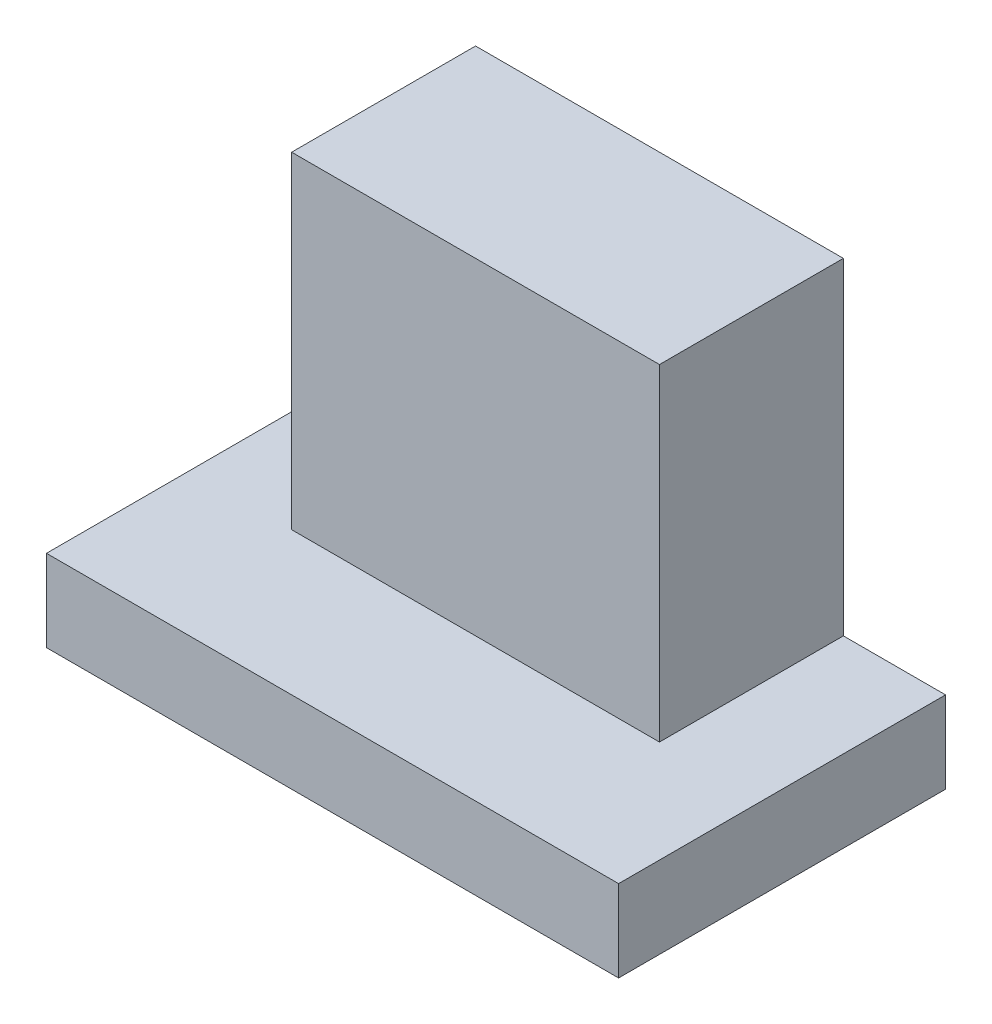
ISO-10303-21;
HEADER;
FILE_DESCRIPTION(('STEP AP214'),'2;1');
FILE_NAME('part.step','',(''),(''),'','','');
FILE_SCHEMA(('AUTOMOTIVE_DESIGN { 1 0 10303 214 1 1 1 1 }'));
ENDSEC;
DATA;
#1=APPLICATION_CONTEXT('core data for automotive mechanical design processes');
#2=APPLICATION_PROTOCOL_DEFINITION('international standard','automotive_design',2000,#1);
#3=PRODUCT_CONTEXT('',#1,'mechanical');
#4=PRODUCT('Part','Part','',(#3));
#5=PRODUCT_RELATED_PRODUCT_CATEGORY('part','',(#4));
#6=PRODUCT_DEFINITION_FORMATION('','',#4);
#7=PRODUCT_DEFINITION_CONTEXT('part definition',#1,'design');
#8=PRODUCT_DEFINITION('design','',#6,#7);
#9=PRODUCT_DEFINITION_SHAPE('','',#8);
#10=(LENGTH_UNIT() NAMED_UNIT(*) SI_UNIT(.MILLI.,.METRE.));
#11=(NAMED_UNIT(*) PLANE_ANGLE_UNIT() SI_UNIT($,.RADIAN.));
#12=(NAMED_UNIT(*) SI_UNIT($,.STERADIAN.) SOLID_ANGLE_UNIT());
#13=UNCERTAINTY_MEASURE_WITH_UNIT(LENGTH_MEASURE(1.E-05),#10,'distance_accuracy_value','');
#14=(GEOMETRIC_REPRESENTATION_CONTEXT(3) GLOBAL_UNCERTAINTY_ASSIGNED_CONTEXT((#13)) GLOBAL_UNIT_ASSIGNED_CONTEXT((#10,
#11,#12)) REPRESENTATION_CONTEXT('',''));
#15=CARTESIAN_POINT('',(0.,0.,0.));
#16=DIRECTION('',(0.,0.,1.));
#17=DIRECTION('',(1.,0.,0.));
#18=AXIS2_PLACEMENT_3D('',#15,#16,#17);
#19=CARTESIAN_POINT('',(-70.,20.,0.));
#20=DIRECTION('',(1.,0.,0.));
#21=DIRECTION('',(0.,0.,-1.));
#22=AXIS2_PLACEMENT_3D('',#19,#20,#21);
#23=PLANE('',#22);
#24=DIRECTION('',(0.,0.,1.));
#25=VECTOR('',#24,1.);
#26=CARTESIAN_POINT('',(-70.,0.,0.));
#27=LINE('',#26,#25);
#28=CARTESIAN_POINT('',(-70.,0.,0.));
#29=VERTEX_POINT('',#28);
#30=CARTESIAN_POINT('',(-70.,0.,80.));
#31=VERTEX_POINT('',#30);
#32=EDGE_CURVE('E117',#29,#31,#27,.T.);
#33=ORIENTED_EDGE('',*,*,#32,.T.);
#34=DIRECTION('',(0.,-1.,0.));
#35=VECTOR('',#34,1.);
#36=CARTESIAN_POINT('',(-70.,20.,80.));
#37=LINE('',#36,#35);
#38=CARTESIAN_POINT('',(-70.,20.,80.));
#39=VERTEX_POINT('',#38);
#40=EDGE_CURVE('E11',#39,#31,#37,.T.);
#41=ORIENTED_EDGE('',*,*,#40,.F.);
#42=DIRECTION('',(0.,0.,1.));
#43=VECTOR('',#42,1.);
#44=CARTESIAN_POINT('',(-70.,20.,0.));
#45=LINE('',#44,#43);
#46=CARTESIAN_POINT('',(-70.,20.,0.));
#47=VERTEX_POINT('',#46);
#48=EDGE_CURVE('E126',#47,#39,#45,.T.);
#49=ORIENTED_EDGE('',*,*,#48,.F.);
#50=DIRECTION('',(0.,-1.,0.));
#51=VECTOR('',#50,1.);
#52=CARTESIAN_POINT('',(-70.,20.,0.));
#53=LINE('',#52,#51);
#54=EDGE_CURVE('E142',#47,#29,#53,.T.);
#55=ORIENTED_EDGE('',*,*,#54,.T.);
#56=EDGE_LOOP('',(#33,#41,#49,#55));
#57=FACE_BOUND('',#56,.T.);
#58=ADVANCED_FACE('F31',(#57),#23,.F.);
#59=CARTESIAN_POINT('',(-70.,20.,80.));
#60=DIRECTION('',(0.,0.,-1.));
#61=DIRECTION('',(-1.,0.,0.));
#62=AXIS2_PLACEMENT_3D('',#59,#60,#61);
#63=PLANE('',#62);
#64=DIRECTION('',(1.,0.,0.));
#65=VECTOR('',#64,1.);
#66=CARTESIAN_POINT('',(-70.,0.,80.));
#67=LINE('',#66,#65);
#68=CARTESIAN_POINT('',(70.,0.,80.));
#69=VERTEX_POINT('',#68);
#70=EDGE_CURVE('E120',#31,#69,#67,.T.);
#71=ORIENTED_EDGE('',*,*,#70,.T.);
#72=DIRECTION('',(0.,-1.,0.));
#73=VECTOR('',#72,1.);
#74=CARTESIAN_POINT('',(70.,20.,80.));
#75=LINE('',#74,#73);
#76=CARTESIAN_POINT('',(70.,20.,80.));
#77=VERTEX_POINT('',#76);
#78=EDGE_CURVE('E39',#77,#69,#75,.T.);
#79=ORIENTED_EDGE('',*,*,#78,.F.);
#80=DIRECTION('',(1.,0.,0.));
#81=VECTOR('',#80,1.);
#82=CARTESIAN_POINT('',(-70.,20.,80.));
#83=LINE('',#82,#81);
#84=EDGE_CURVE('E129',#39,#77,#83,.T.);
#85=ORIENTED_EDGE('',*,*,#84,.F.);
#86=ORIENTED_EDGE('',*,*,#40,.T.);
#87=EDGE_LOOP('',(#71,#79,#85,#86));
#88=FACE_BOUND('',#87,.T.);
#89=ADVANCED_FACE('F155',(#88),#63,.F.);
#90=CARTESIAN_POINT('',(70.,20.,0.));
#91=DIRECTION('',(-1.,0.,0.));
#92=DIRECTION('',(0.,0.,1.));
#93=AXIS2_PLACEMENT_3D('',#90,#91,#92);
#94=PLANE('',#93);
#95=DIRECTION('',(0.,0.,-1.));
#96=VECTOR('',#95,1.);
#97=CARTESIAN_POINT('',(70.,0.,0.));
#98=LINE('',#97,#96);
#99=CARTESIAN_POINT('',(70.,0.,0.));
#100=VERTEX_POINT('',#99);
#101=EDGE_CURVE('E152',#69,#100,#98,.T.);
#102=ORIENTED_EDGE('',*,*,#101,.T.);
#103=DIRECTION('',(0.,-1.,0.));
#104=VECTOR('',#103,1.);
#105=CARTESIAN_POINT('',(70.,20.,0.));
#106=LINE('',#105,#104);
#107=CARTESIAN_POINT('',(70.,20.,0.));
#108=VERTEX_POINT('',#107);
#109=EDGE_CURVE('E146',#108,#100,#106,.T.);
#110=ORIENTED_EDGE('',*,*,#109,.F.);
#111=DIRECTION('',(0.,0.,-1.));
#112=VECTOR('',#111,1.);
#113=CARTESIAN_POINT('',(70.,20.,0.));
#114=LINE('',#113,#112);
#115=EDGE_CURVE('E132',#77,#108,#114,.T.);
#116=ORIENTED_EDGE('',*,*,#115,.F.);
#117=ORIENTED_EDGE('',*,*,#78,.T.);
#118=EDGE_LOOP('',(#102,#110,#116,#117));
#119=FACE_BOUND('',#118,.T.);
#120=ADVANCED_FACE('F162',(#119),#94,.F.);
#121=CARTESIAN_POINT('',(-70.,20.,0.));
#122=DIRECTION('',(0.,0.,1.));
#123=DIRECTION('',(1.,0.,0.));
#124=AXIS2_PLACEMENT_3D('',#121,#122,#123);
#125=PLANE('',#124);
#126=DIRECTION('',(-1.,0.,0.));
#127=VECTOR('',#126,1.);
#128=CARTESIAN_POINT('',(-70.,0.,0.));
#129=LINE('',#128,#127);
#130=EDGE_CURVE('E130',#100,#29,#129,.T.);
#131=ORIENTED_EDGE('',*,*,#130,.T.);
#132=ORIENTED_EDGE('',*,*,#54,.F.);
#133=DIRECTION('',(-1.,0.,0.));
#134=VECTOR('',#133,1.);
#135=CARTESIAN_POINT('',(-70.,20.,0.));
#136=LINE('',#135,#134);
#137=CARTESIAN_POINT('',(-45.,20.,0.));
#138=VERTEX_POINT('',#137);
#139=EDGE_CURVE('E134',#138,#47,#136,.T.);
#140=ORIENTED_EDGE('',*,*,#139,.F.);
#141=DIRECTION('',(0.,-1.,0.));
#142=VECTOR('',#141,1.);
#143=CARTESIAN_POINT('',(-45.,100.,0.));
#144=LINE('',#143,#142);
#145=CARTESIAN_POINT('',(-45.,100.,0.));
#146=VERTEX_POINT('',#145);
#147=EDGE_CURVE('E173',#146,#138,#144,.T.);
#148=ORIENTED_EDGE('',*,*,#147,.F.);
#149=DIRECTION('',(-1.,0.,0.));
#150=VECTOR('',#149,1.);
#151=CARTESIAN_POINT('',(-45.,100.,0.));
#152=LINE('',#151,#150);
#153=CARTESIAN_POINT('',(45.,100.,0.));
#154=VERTEX_POINT('',#153);
#155=EDGE_CURVE('E110',#154,#146,#152,.T.);
#156=ORIENTED_EDGE('',*,*,#155,.F.);
#157=DIRECTION('',(0.,-1.,0.));
#158=VECTOR('',#157,1.);
#159=CARTESIAN_POINT('',(45.,100.,0.));
#160=LINE('',#159,#158);
#161=CARTESIAN_POINT('',(45.,20.,0.));
#162=VERTEX_POINT('',#161);
#163=EDGE_CURVE('E122',#154,#162,#160,.T.);
#164=ORIENTED_EDGE('',*,*,#163,.T.);
#165=EDGE_CURVE('E141',#108,#162,#136,.T.);
#166=ORIENTED_EDGE('',*,*,#165,.F.);
#167=ORIENTED_EDGE('',*,*,#109,.T.);
#168=EDGE_LOOP('',(#131,#132,#140,#148,#156,#164,#166,#167));
#169=FACE_BOUND('',#168,.T.);
#170=ADVANCED_FACE('F168',(#169),#125,.F.);
#171=CARTESIAN_POINT('',(-70.,20.,0.));
#172=DIRECTION('',(0.,1.,0.));
#173=DIRECTION('',(0.,0.,1.));
#174=AXIS2_PLACEMENT_3D('',#171,#172,#173);
#175=PLANE('',#174);
#176=DIRECTION('',(0.,0.,1.));
#177=VECTOR('',#176,1.);
#178=CARTESIAN_POINT('',(-45.,20.,0.));
#179=LINE('',#178,#177);
#180=CARTESIAN_POINT('',(-45.,20.,45.));
#181=VERTEX_POINT('',#180);
#182=EDGE_CURVE('E52',#138,#181,#179,.T.);
#183=ORIENTED_EDGE('',*,*,#182,.F.);
#184=ORIENTED_EDGE('',*,*,#139,.T.);
#185=ORIENTED_EDGE('',*,*,#48,.T.);
#186=ORIENTED_EDGE('',*,*,#84,.T.);
#187=ORIENTED_EDGE('',*,*,#115,.T.);
#188=ORIENTED_EDGE('',*,*,#165,.T.);
#189=DIRECTION('',(0.,0.,-1.));
#190=VECTOR('',#189,1.);
#191=CARTESIAN_POINT('',(45.,20.,0.));
#192=LINE('',#191,#190);
#193=CARTESIAN_POINT('',(45.,20.,45.));
#194=VERTEX_POINT('',#193);
#195=EDGE_CURVE('E114',#194,#162,#192,.T.);
#196=ORIENTED_EDGE('',*,*,#195,.F.);
#197=DIRECTION('',(1.,0.,0.));
#198=VECTOR('',#197,1.);
#199=CARTESIAN_POINT('',(-45.,20.,45.));
#200=LINE('',#199,#198);
#201=EDGE_CURVE('E47',#181,#194,#200,.T.);
#202=ORIENTED_EDGE('',*,*,#201,.F.);
#203=EDGE_LOOP('',(#183,#184,#185,#186,#187,#188,#196,#202));
#204=FACE_BOUND('',#203,.T.);
#205=ADVANCED_FACE('F172',(#204),#175,.T.);
#206=CARTESIAN_POINT('',(-70.,0.,0.));
#207=DIRECTION('',(0.,1.,0.));
#208=DIRECTION('',(0.,0.,1.));
#209=AXIS2_PLACEMENT_3D('',#206,#207,#208);
#210=PLANE('',#209);
#211=ORIENTED_EDGE('',*,*,#32,.F.);
#212=ORIENTED_EDGE('',*,*,#130,.F.);
#213=ORIENTED_EDGE('',*,*,#101,.F.);
#214=ORIENTED_EDGE('',*,*,#70,.F.);
#215=EDGE_LOOP('',(#211,#212,#213,#214));
#216=FACE_BOUND('',#215,.T.);
#217=ADVANCED_FACE('F165',(#216),#210,.F.);
#218=CARTESIAN_POINT('',(-45.,100.,0.));
#219=DIRECTION('',(1.,0.,0.));
#220=DIRECTION('',(0.,0.,-1.));
#221=AXIS2_PLACEMENT_3D('',#218,#219,#220);
#222=PLANE('',#221);
#223=ORIENTED_EDGE('',*,*,#182,.T.);
#224=DIRECTION('',(0.,-1.,0.));
#225=VECTOR('',#224,1.);
#226=CARTESIAN_POINT('',(-45.,100.,45.));
#227=LINE('',#226,#225);
#228=CARTESIAN_POINT('',(-45.,100.,45.));
#229=VERTEX_POINT('',#228);
#230=EDGE_CURVE('E99',#229,#181,#227,.T.);
#231=ORIENTED_EDGE('',*,*,#230,.F.);
#232=DIRECTION('',(0.,0.,1.));
#233=VECTOR('',#232,1.);
#234=CARTESIAN_POINT('',(-45.,100.,0.));
#235=LINE('',#234,#233);
#236=EDGE_CURVE('E105',#146,#229,#235,.T.);
#237=ORIENTED_EDGE('',*,*,#236,.F.);
#238=ORIENTED_EDGE('',*,*,#147,.T.);
#239=EDGE_LOOP('',(#223,#231,#237,#238));
#240=FACE_BOUND('',#239,.T.);
#241=ADVANCED_FACE('F116',(#240),#222,.F.);
#242=CARTESIAN_POINT('',(-45.,100.,45.));
#243=DIRECTION('',(0.,0.,-1.));
#244=DIRECTION('',(-1.,0.,0.));
#245=AXIS2_PLACEMENT_3D('',#242,#243,#244);
#246=PLANE('',#245);
#247=ORIENTED_EDGE('',*,*,#201,.T.);
#248=DIRECTION('',(0.,-1.,0.));
#249=VECTOR('',#248,1.);
#250=CARTESIAN_POINT('',(45.,100.,45.));
#251=LINE('',#250,#249);
#252=CARTESIAN_POINT('',(45.,100.,45.));
#253=VERTEX_POINT('',#252);
#254=EDGE_CURVE('E101',#253,#194,#251,.T.);
#255=ORIENTED_EDGE('',*,*,#254,.F.);
#256=DIRECTION('',(1.,0.,0.));
#257=VECTOR('',#256,1.);
#258=CARTESIAN_POINT('',(-45.,100.,45.));
#259=LINE('',#258,#257);
#260=EDGE_CURVE('E95',#229,#253,#259,.T.);
#261=ORIENTED_EDGE('',*,*,#260,.F.);
#262=ORIENTED_EDGE('',*,*,#230,.T.);
#263=EDGE_LOOP('',(#247,#255,#261,#262));
#264=FACE_BOUND('',#263,.T.);
#265=ADVANCED_FACE('F97',(#264),#246,.F.);
#266=CARTESIAN_POINT('',(45.,100.,0.));
#267=DIRECTION('',(-1.,0.,0.));
#268=DIRECTION('',(0.,0.,1.));
#269=AXIS2_PLACEMENT_3D('',#266,#267,#268);
#270=PLANE('',#269);
#271=ORIENTED_EDGE('',*,*,#195,.T.);
#272=ORIENTED_EDGE('',*,*,#163,.F.);
#273=DIRECTION('',(0.,0.,-1.));
#274=VECTOR('',#273,1.);
#275=CARTESIAN_POINT('',(45.,100.,0.));
#276=LINE('',#275,#274);
#277=EDGE_CURVE('E104',#253,#154,#276,.T.);
#278=ORIENTED_EDGE('',*,*,#277,.F.);
#279=ORIENTED_EDGE('',*,*,#254,.T.);
#280=EDGE_LOOP('',(#271,#272,#278,#279));
#281=FACE_BOUND('',#280,.T.);
#282=ADVANCED_FACE('F188',(#281),#270,.F.);
#283=CARTESIAN_POINT('',(-45.,100.,45.));
#284=DIRECTION('',(0.,1.,0.));
#285=DIRECTION('',(0.,0.,1.));
#286=AXIS2_PLACEMENT_3D('',#283,#284,#285);
#287=PLANE('',#286);
#288=ORIENTED_EDGE('',*,*,#236,.T.);
#289=ORIENTED_EDGE('',*,*,#260,.T.);
#290=ORIENTED_EDGE('',*,*,#277,.T.);
#291=ORIENTED_EDGE('',*,*,#155,.T.);
#292=EDGE_LOOP('',(#288,#289,#290,#291));
#293=FACE_BOUND('',#292,.T.);
#294=ADVANCED_FACE('F108',(#293),#287,.T.);
#295=CLOSED_SHELL('',(#58,#89,#120,#170,#205,#217,#241,#265,#282,#294));
#296=MANIFOLD_SOLID_BREP('B2',#295);
#297=ADVANCED_BREP_SHAPE_REPRESENTATION('',(#18,#296),#14);
#298=SHAPE_DEFINITION_REPRESENTATION(#9,#297);
ENDSEC;
END-ISO-10303-21;
